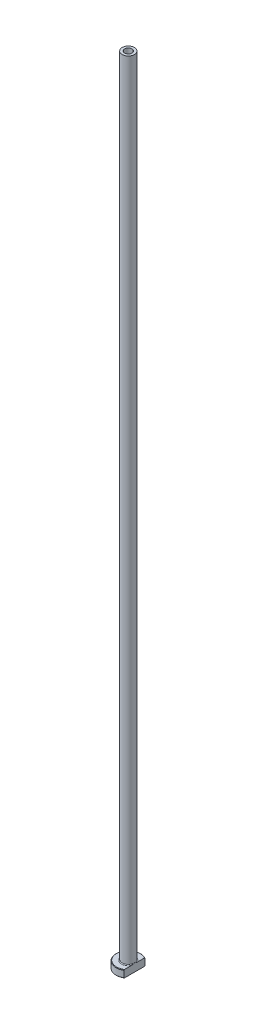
ISO-10303-21;
HEADER;
FILE_DESCRIPTION(('STEP AP214'),'2;1');
FILE_NAME('part.step','',(''),(''),'','','');
FILE_SCHEMA(('AUTOMOTIVE_DESIGN { 1 0 10303 214 1 1 1 1 }'));
ENDSEC;
DATA;
#1=APPLICATION_CONTEXT('core data for automotive mechanical design processes');
#2=APPLICATION_PROTOCOL_DEFINITION('international standard','automotive_design',2000,#1);
#3=PRODUCT_CONTEXT('',#1,'mechanical');
#4=PRODUCT('Part','Part','',(#3));
#5=PRODUCT_RELATED_PRODUCT_CATEGORY('part','',(#4));
#6=PRODUCT_DEFINITION_FORMATION('','',#4);
#7=PRODUCT_DEFINITION_CONTEXT('part definition',#1,'design');
#8=PRODUCT_DEFINITION('design','',#6,#7);
#9=PRODUCT_DEFINITION_SHAPE('','',#8);
#10=(LENGTH_UNIT() NAMED_UNIT(*) SI_UNIT(.MILLI.,.METRE.));
#11=(NAMED_UNIT(*) PLANE_ANGLE_UNIT() SI_UNIT($,.RADIAN.));
#12=(NAMED_UNIT(*) SI_UNIT($,.STERADIAN.) SOLID_ANGLE_UNIT());
#13=UNCERTAINTY_MEASURE_WITH_UNIT(LENGTH_MEASURE(1.E-05),#10,'distance_accuracy_value','');
#14=(GEOMETRIC_REPRESENTATION_CONTEXT(3) GLOBAL_UNCERTAINTY_ASSIGNED_CONTEXT((#13)) GLOBAL_UNIT_ASSIGNED_CONTEXT((#10,
#11,#12)) REPRESENTATION_CONTEXT('',''));
#15=CARTESIAN_POINT('',(0.,0.,0.));
#16=DIRECTION('',(0.,0.,1.));
#17=DIRECTION('',(1.,0.,0.));
#18=AXIS2_PLACEMENT_3D('',#15,#16,#17);
#19=CARTESIAN_POINT('',(0.,92.1876809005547,0.));
#20=DIRECTION('',(0.,1.,0.));
#21=DIRECTION('',(0.,0.,1.));
#22=AXIS2_PLACEMENT_3D('',#19,#20,#21);
#23=CYLINDRICAL_SURFACE('',#22,1.50000000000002);
#24=CARTESIAN_POINT('',(0.,325.,0.));
#25=DIRECTION('',(0.,1.,0.));
#26=DIRECTION('',(0.,0.,1.));
#27=AXIS2_PLACEMENT_3D('',#24,#25,#26);
#28=CIRCLE('',#27,1.50000000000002);
#29=CARTESIAN_POINT('',(0.,325.,1.50000000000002));
#30=VERTEX_POINT('',#29);
#31=EDGE_CURVE('E167',#30,#30,#28,.T.);
#32=ORIENTED_EDGE('',*,*,#31,.T.);
#33=EDGE_LOOP('',(#32));
#34=FACE_BOUND('',#33,.T.);
#35=CARTESIAN_POINT('',(0.,280.,0.));
#36=DIRECTION('',(0.,1.,0.));
#37=DIRECTION('',(0.,0.,1.));
#38=AXIS2_PLACEMENT_3D('',#35,#36,#37);
#39=CIRCLE('',#38,1.50000000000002);
#40=CARTESIAN_POINT('',(0.,280.,1.50000000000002));
#41=VERTEX_POINT('',#40);
#42=EDGE_CURVE('E170',#41,#41,#39,.T.);
#43=ORIENTED_EDGE('',*,*,#42,.F.);
#44=EDGE_LOOP('',(#43));
#45=FACE_BOUND('',#44,.T.);
#46=ADVANCED_FACE('F32',(#34,#45),#23,.F.);
#47=CARTESIAN_POINT('',(-1.50000000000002,325.,0.));
#48=DIRECTION('',(0.,1.,0.));
#49=DIRECTION('',(0.,0.,1.));
#50=AXIS2_PLACEMENT_3D('',#47,#48,#49);
#51=PLANE('',#50);
#52=CARTESIAN_POINT('',(0.,325.,0.));
#53=DIRECTION('',(0.,1.,0.));
#54=DIRECTION('',(0.,0.,1.));
#55=AXIS2_PLACEMENT_3D('',#52,#53,#54);
#56=CIRCLE('',#55,2.50000000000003);
#57=CARTESIAN_POINT('',(0.,325.,2.50000000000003));
#58=VERTEX_POINT('',#57);
#59=EDGE_CURVE('E174',#58,#58,#56,.T.);
#60=ORIENTED_EDGE('',*,*,#59,.T.);
#61=EDGE_LOOP('',(#60));
#62=FACE_BOUND('',#61,.T.);
#63=ORIENTED_EDGE('',*,*,#31,.F.);
#64=EDGE_LOOP('',(#63));
#65=FACE_BOUND('',#64,.T.);
#66=ADVANCED_FACE('F157',(#62,#65),#51,.T.);
#67=CARTESIAN_POINT('',(0.,92.1876809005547,0.));
#68=DIRECTION('',(0.,1.,0.));
#69=DIRECTION('',(0.,0.,1.));
#70=AXIS2_PLACEMENT_3D('',#67,#68,#69);
#71=CYLINDRICAL_SURFACE('',#70,2.50000000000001);
#72=CARTESIAN_POINT('',(0.,3.3,0.));
#73=DIRECTION('',(0.,1.,0.));
#74=DIRECTION('',(0.,0.,1.));
#75=AXIS2_PLACEMENT_3D('',#72,#73,#74);
#76=CIRCLE('',#75,2.50000000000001);
#77=CARTESIAN_POINT('',(2.5,3.3,0.));
#78=VERTEX_POINT('',#77);
#79=EDGE_CURVE('E180',#78,#78,#76,.T.);
#80=ORIENTED_EDGE('',*,*,#79,.T.);
#81=EDGE_LOOP('',(#80));
#82=FACE_BOUND('',#81,.T.);
#83=ORIENTED_EDGE('',*,*,#59,.F.);
#84=EDGE_LOOP('',(#83));
#85=FACE_BOUND('',#84,.T.);
#86=ADVANCED_FACE('F162',(#82,#85),#71,.T.);
#87=CARTESIAN_POINT('',(-2.49999999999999,3.,0.));
#88=DIRECTION('',(0.,1.,0.));
#89=DIRECTION('',(0.,0.,1.));
#90=AXIS2_PLACEMENT_3D('',#87,#88,#89);
#91=PLANE('',#90);
#92=DIRECTION('',(0.,0.,1.));
#93=VECTOR('',#92,1.);
#94=CARTESIAN_POINT('',(2.49999999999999,3.,0.));
#95=LINE('',#94,#93);
#96=CARTESIAN_POINT('',(2.5,3.,-4.09756024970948));
#97=VERTEX_POINT('',#96);
#98=CARTESIAN_POINT('',(2.49999999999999,3.,-1.26095202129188));
#99=VERTEX_POINT('',#98);
#100=EDGE_CURVE('E54',#97,#99,#95,.T.);
#101=ORIENTED_EDGE('',*,*,#100,.F.);
#102=CARTESIAN_POINT('',(0.,3.,0.));
#103=DIRECTION('',(0.,1.,0.));
#104=DIRECTION('',(0.,0.,1.));
#105=AXIS2_PLACEMENT_3D('',#102,#103,#104);
#106=CIRCLE('',#105,4.79999999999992);
#107=CARTESIAN_POINT('',(2.49999999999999,3.,4.09756024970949));
#108=VERTEX_POINT('',#107);
#109=EDGE_CURVE('E186',#97,#108,#106,.T.);
#110=ORIENTED_EDGE('',*,*,#109,.T.);
#111=CARTESIAN_POINT('',(2.49999999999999,3.,1.26095202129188));
#112=VERTEX_POINT('',#111);
#113=EDGE_CURVE('E134',#112,#108,#95,.T.);
#114=ORIENTED_EDGE('',*,*,#113,.F.);
#115=CARTESIAN_POINT('',(0.,3.,0.));
#116=DIRECTION('',(0.,1.,0.));
#117=DIRECTION('',(0.,0.,1.));
#118=AXIS2_PLACEMENT_3D('',#115,#116,#117);
#119=CIRCLE('',#118,2.80000000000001);
#120=EDGE_CURVE('E183',#112,#99,#119,.F.);
#121=ORIENTED_EDGE('',*,*,#120,.T.);
#122=EDGE_LOOP('',(#101,#110,#114,#121));
#123=FACE_BOUND('',#122,.T.);
#124=ADVANCED_FACE('F197',(#123),#91,.T.);
#125=CARTESIAN_POINT('',(0.,92.1876809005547,0.));
#126=DIRECTION('',(0.,1.,0.));
#127=DIRECTION('',(0.,0.,1.));
#128=AXIS2_PLACEMENT_3D('',#125,#126,#127);
#129=CYLINDRICAL_SURFACE('',#128,4.99999999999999);
#130=DIRECTION('',(0.,-1.,0.));
#131=VECTOR('',#130,1.);
#132=CARTESIAN_POINT('',(2.49999999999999,325.,4.33012701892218));
#133=LINE('',#132,#131);
#134=CARTESIAN_POINT('',(2.49999999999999,2.79999999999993,4.33012701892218));
#135=VERTEX_POINT('',#134);
#136=CARTESIAN_POINT('',(2.49999999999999,0.200000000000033,4.33012701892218));
#137=VERTEX_POINT('',#136);
#138=EDGE_CURVE('E82',#135,#137,#133,.T.);
#139=ORIENTED_EDGE('',*,*,#138,.F.);
#140=CARTESIAN_POINT('',(0.,2.79999999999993,0.));
#141=DIRECTION('',(0.,1.,0.));
#142=DIRECTION('',(0.,0.,1.));
#143=AXIS2_PLACEMENT_3D('',#140,#141,#142);
#144=CIRCLE('',#143,4.99999999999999);
#145=CARTESIAN_POINT('',(2.5,2.79999999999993,-4.33012701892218));
#146=VERTEX_POINT('',#145);
#147=EDGE_CURVE('E95',#135,#146,#144,.F.);
#148=ORIENTED_EDGE('',*,*,#147,.T.);
#149=DIRECTION('',(0.,-1.,0.));
#150=VECTOR('',#149,1.);
#151=CARTESIAN_POINT('',(2.5,325.,-4.33012701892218));
#152=LINE('',#151,#150);
#153=CARTESIAN_POINT('',(2.5,0.200000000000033,-4.33012701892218));
#154=VERTEX_POINT('',#153);
#155=EDGE_CURVE('E192',#146,#154,#152,.T.);
#156=ORIENTED_EDGE('',*,*,#155,.T.);
#157=CARTESIAN_POINT('',(0.,0.200000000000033,0.));
#158=DIRECTION('',(0.,-1.,0.));
#159=DIRECTION('',(0.,0.,-1.));
#160=AXIS2_PLACEMENT_3D('',#157,#158,#159);
#161=CIRCLE('',#160,4.99999999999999);
#162=EDGE_CURVE('E98',#154,#137,#161,.F.);
#163=ORIENTED_EDGE('',*,*,#162,.T.);
#164=EDGE_LOOP('',(#139,#148,#156,#163));
#165=FACE_BOUND('',#164,.T.);
#166=ADVANCED_FACE('F190',(#165),#129,.T.);
#167=CARTESIAN_POINT('',(-4.99999999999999,0.,0.));
#168=DIRECTION('',(0.,-1.,0.));
#169=DIRECTION('',(0.,0.,-1.));
#170=AXIS2_PLACEMENT_3D('',#167,#168,#169);
#171=PLANE('',#170);
#172=CARTESIAN_POINT('',(0.,0.,0.));
#173=DIRECTION('',(0.,-1.,0.));
#174=DIRECTION('',(0.,0.,-1.));
#175=AXIS2_PLACEMENT_3D('',#172,#173,#174);
#176=CIRCLE('',#175,2.25000000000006);
#177=CARTESIAN_POINT('',(0.,0.,-2.25000000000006));
#178=VERTEX_POINT('',#177);
#179=EDGE_CURVE('E40',#178,#178,#176,.F.);
#180=ORIENTED_EDGE('',*,*,#179,.T.);
#181=EDGE_LOOP('',(#180));
#182=FACE_BOUND('',#181,.T.);
#183=DIRECTION('',(0.,0.,-1.));
#184=VECTOR('',#183,1.);
#185=CARTESIAN_POINT('',(2.49999999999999,0.,4.33012701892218));
#186=LINE('',#185,#184);
#187=CARTESIAN_POINT('',(2.49999999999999,0.,4.09756024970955));
#188=VERTEX_POINT('',#187);
#189=CARTESIAN_POINT('',(2.5,0.,-4.09756024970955));
#190=VERTEX_POINT('',#189);
#191=EDGE_CURVE('E47',#188,#190,#186,.T.);
#192=ORIENTED_EDGE('',*,*,#191,.F.);
#193=CARTESIAN_POINT('',(0.,0.,0.));
#194=DIRECTION('',(0.,-1.,0.));
#195=DIRECTION('',(0.,0.,-1.));
#196=AXIS2_PLACEMENT_3D('',#193,#194,#195);
#197=CIRCLE('',#196,4.79999999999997);
#198=EDGE_CURVE('E92',#188,#190,#197,.T.);
#199=ORIENTED_EDGE('',*,*,#198,.T.);
#200=EDGE_LOOP('',(#192,#199));
#201=FACE_BOUND('',#200,.T.);
#202=ADVANCED_FACE('F91',(#182,#201),#171,.T.);
#203=CARTESIAN_POINT('',(0.,92.1876809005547,0.));
#204=DIRECTION('',(0.,1.,0.));
#205=DIRECTION('',(0.,0.,1.));
#206=AXIS2_PLACEMENT_3D('',#203,#204,#205);
#207=CYLINDRICAL_SURFACE('',#206,1.75000000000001);
#208=CARTESIAN_POINT('',(0.,0.500000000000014,0.));
#209=DIRECTION('',(0.,-1.,0.));
#210=DIRECTION('',(0.,0.,-1.));
#211=AXIS2_PLACEMENT_3D('',#208,#209,#210);
#212=CIRCLE('',#211,1.75000000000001);
#213=CARTESIAN_POINT('',(0.,0.500000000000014,-1.75000000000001));
#214=VERTEX_POINT('',#213);
#215=EDGE_CURVE('E11',#214,#214,#212,.T.);
#216=ORIENTED_EDGE('',*,*,#215,.T.);
#217=EDGE_LOOP('',(#216));
#218=FACE_BOUND('',#217,.T.);
#219=CARTESIAN_POINT('',(0.,268.,0.));
#220=DIRECTION('',(0.,1.,0.));
#221=DIRECTION('',(0.,0.,1.));
#222=AXIS2_PLACEMENT_3D('',#219,#220,#221);
#223=CIRCLE('',#222,1.75000000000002);
#224=CARTESIAN_POINT('',(0.,268.,1.75000000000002));
#225=VERTEX_POINT('',#224);
#226=EDGE_CURVE('E172',#225,#225,#223,.T.);
#227=ORIENTED_EDGE('',*,*,#226,.T.);
#228=EDGE_LOOP('',(#227));
#229=FACE_BOUND('',#228,.T.);
#230=ADVANCED_FACE('F215',(#218,#229),#207,.F.);
#231=CARTESIAN_POINT('',(0.,268.,0.));
#232=DIRECTION('',(0.,-1.,0.));
#233=DIRECTION('',(0.,0.,-1.));
#234=AXIS2_PLACEMENT_3D('',#231,#232,#233);
#235=CONICAL_SURFACE('',#234,1.75000000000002,0.0208303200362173);
#236=ORIENTED_EDGE('',*,*,#42,.T.);
#237=EDGE_LOOP('',(#236));
#238=FACE_BOUND('',#237,.T.);
#239=ORIENTED_EDGE('',*,*,#226,.F.);
#240=EDGE_LOOP('',(#239));
#241=FACE_BOUND('',#240,.T.);
#242=ADVANCED_FACE('F111',(#238,#241),#235,.F.);
#243=CARTESIAN_POINT('',(0.,3.3,0.));
#244=DIRECTION('',(0.,1.,0.));
#245=DIRECTION('',(0.,0.,1.));
#246=AXIS2_PLACEMENT_3D('',#243,#244,#245);
#247=TOROIDAL_SURFACE('',#246,2.80000000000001,0.3);
#248=ORIENTED_EDGE('',*,*,#120,.F.);
#249=CARTESIAN_POINT('',(2.5,3.3,0.));
#250=CARTESIAN_POINT('',(2.5,3.30000062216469,-4.84331938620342E-11));
#251=CARTESIAN_POINT('',(2.5,3.30000124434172,1.596211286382E-07));
#252=CARTESIAN_POINT('',(2.5,3.30000243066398,6.4547816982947E-07));
#253=CARTESIAN_POINT('',(2.5,3.30000299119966,9.78480972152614E-07));
#254=CARTESIAN_POINT('',(2.5,3.30000411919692,1.77472021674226E-06));
#255=CARTESIAN_POINT('',(2.5,3.30000467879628,2.24902194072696E-06));
#256=CARTESIAN_POINT('',(2.5,3.30000572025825,3.25953741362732E-06));
#257=CARTESIAN_POINT('',(2.5,3.30000620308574,3.79480804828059E-06));
#258=CARTESIAN_POINT('',(2.5,3.30000787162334,5.75794736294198E-06));
#259=CARTESIAN_POINT('',(2.5,3.30000896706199,7.2642425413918E-06));
#260=CARTESIAN_POINT('',(2.5,3.30001087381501,1.03361146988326E-05));
#261=CARTESIAN_POINT('',(2.5,3.30001169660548,1.18949516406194E-05));
#262=CARTESIAN_POINT('',(2.5,3.30001489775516,1.81400881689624E-05));
#263=CARTESIAN_POINT('',(2.5,3.30001712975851,2.29062218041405E-05));
#264=CARTESIAN_POINT('',(2.5,3.30002067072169,3.21793914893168E-05));
#265=CARTESIAN_POINT('',(2.5,3.30002205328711,3.66589034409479E-05));
#266=CARTESIAN_POINT('',(2.5,3.30002810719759,5.6171847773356E-05));
#267=CARTESIAN_POINT('',(2.5,3.30003284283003,7.1173596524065E-05));
#268=CARTESIAN_POINT('',(2.5,3.30004025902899,9.8992044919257E-05));
#269=CARTESIAN_POINT('',(2.5,3.3000431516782,0.00011174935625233));
#270=CARTESIAN_POINT('',(2.49999999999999,3.30006652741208,0.000206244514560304));
#271=CARTESIAN_POINT('',(2.49999999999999,3.30009698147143,0.000285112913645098));
#272=CARTESIAN_POINT('',(2.5,3.30021213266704,0.000594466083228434));
#273=CARTESIAN_POINT('',(2.5,3.30028938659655,0.000826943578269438));
#274=CARTESIAN_POINT('',(2.49999999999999,3.30059681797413,0.00173885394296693));
#275=CARTESIAN_POINT('',(2.49999999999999,3.30083479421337,0.00241625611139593));
#276=CARTESIAN_POINT('',(2.5,3.30181198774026,0.00521069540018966));
#277=CARTESIAN_POINT('',(2.5,3.30254240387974,0.00732996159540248));
#278=CARTESIAN_POINT('',(2.49999999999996,3.31226043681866,0.0355096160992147));
#279=CARTESIAN_POINT('',(2.49999999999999,3.32130808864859,0.0615551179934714));
#280=CARTESIAN_POINT('',(2.5,3.33896212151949,0.112677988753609));
#281=CARTESIAN_POINT('',(2.5,3.34757212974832,0.137754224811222));
#282=CARTESIAN_POINT('',(2.49999999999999,3.36573068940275,0.190981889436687));
#283=CARTESIAN_POINT('',(2.49999999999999,3.37526654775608,0.21913775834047));
#284=CARTESIAN_POINT('',(2.5,3.39422867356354,0.275816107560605));
#285=CARTESIAN_POINT('',(2.5,3.40365272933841,0.304339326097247));
#286=CARTESIAN_POINT('',(2.49999999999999,3.42641697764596,0.374416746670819));
#287=CARTESIAN_POINT('',(2.5,3.43959811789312,0.41602308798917));
#288=CARTESIAN_POINT('',(2.5,3.46479157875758,0.498481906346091));
#289=CARTESIAN_POINT('',(2.5,3.47682455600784,0.539328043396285));
#290=CARTESIAN_POINT('',(2.5,3.50224427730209,0.629981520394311));
#291=CARTESIAN_POINT('',(2.5,3.51538048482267,0.679860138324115));
#292=CARTESIAN_POINT('',(2.5,3.53964074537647,0.780511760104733));
#293=CARTESIAN_POINT('',(2.5,3.55074877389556,0.831288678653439));
#294=CARTESIAN_POINT('',(2.5,3.57087054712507,0.937063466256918));
#295=CARTESIAN_POINT('',(2.5,3.57967623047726,0.992102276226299));
#296=CARTESIAN_POINT('',(2.5,3.59301148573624,1.10256024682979));
#297=CARTESIAN_POINT('',(2.5,3.59755297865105,1.15797790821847));
#298=CARTESIAN_POINT('',(2.5,3.60093314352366,1.26786705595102));
#299=CARTESIAN_POINT('',(2.5,3.59989366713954,1.32233291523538));
#300=CARTESIAN_POINT('',(2.5,3.59277279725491,1.40310062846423));
#301=CARTESIAN_POINT('',(2.5,3.5895213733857,1.4296522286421));
#302=CARTESIAN_POINT('',(2.5,3.58085857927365,1.48239078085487));
#303=CARTESIAN_POINT('',(2.5,3.57544928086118,1.50857805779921));
#304=CARTESIAN_POINT('',(2.5,3.56298810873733,1.55658799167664));
#305=CARTESIAN_POINT('',(2.5,3.5562820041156,1.57849902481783));
#306=CARTESIAN_POINT('',(2.5,3.54055393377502,1.62160292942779));
#307=CARTESIAN_POINT('',(2.5,3.53152220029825,1.64279233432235));
#308=CARTESIAN_POINT('',(2.5,3.510571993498,1.68404469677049));
#309=CARTESIAN_POINT('',(2.5,3.4986201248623,1.70409105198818));
#310=CARTESIAN_POINT('',(2.5,3.47134074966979,1.74172093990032));
#311=CARTESIAN_POINT('',(2.5,3.4560312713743,1.75931683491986));
#312=CARTESIAN_POINT('',(2.5,3.42979930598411,1.78297070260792));
#313=CARTESIAN_POINT('',(2.5,3.42024268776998,1.79054141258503));
#314=CARTESIAN_POINT('',(2.5,3.40009035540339,1.80416997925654));
#315=CARTESIAN_POINT('',(2.5,3.38949499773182,1.81022835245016));
#316=CARTESIAN_POINT('',(2.5,3.36727740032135,1.82047087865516));
#317=CARTESIAN_POINT('',(2.5,3.35564531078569,1.82463409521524));
#318=CARTESIAN_POINT('',(2.5,3.33178837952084,1.83058442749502));
#319=CARTESIAN_POINT('',(2.5,3.31956435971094,1.83237474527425));
#320=CARTESIAN_POINT('',(2.5,3.29665736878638,1.8333185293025));
#321=CARTESIAN_POINT('',(2.5,3.28598670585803,1.83279233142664));
#322=CARTESIAN_POINT('',(2.5,3.26490749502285,1.82986307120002));
#323=CARTESIAN_POINT('',(2.5,3.25449899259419,1.82745968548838));
#324=CARTESIAN_POINT('',(2.5,3.23467098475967,1.82111257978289));
#325=CARTESIAN_POINT('',(2.5,3.22522816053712,1.81724026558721));
#326=CARTESIAN_POINT('',(2.5,3.20699535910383,1.80819497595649));
#327=CARTESIAN_POINT('',(2.5,3.19820556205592,1.80302164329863));
#328=CARTESIAN_POINT('',(2.5,3.1766316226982,1.78842115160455));
#329=CARTESIAN_POINT('',(2.5,3.16436228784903,1.77823293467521));
#330=CARTESIAN_POINT('',(2.5,3.14157828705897,1.75604629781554));
#331=CARTESIAN_POINT('',(2.5,3.13106906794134,1.74404246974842));
#332=CARTESIAN_POINT('',(2.5,3.10600520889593,1.71142114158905));
#333=CARTESIAN_POINT('',(2.5,3.09267476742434,1.68986887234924));
#334=CARTESIAN_POINT('',(2.5,3.06940323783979,1.64508572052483));
#335=CARTESIAN_POINT('',(2.5,3.05946314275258,1.62185434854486));
#336=CARTESIAN_POINT('',(2.5,3.03545750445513,1.55546754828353));
#337=CARTESIAN_POINT('',(2.5,3.02444022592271,1.51122187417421));
#338=CARTESIAN_POINT('',(2.5,3.00863926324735,1.42119777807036));
#339=CARTESIAN_POINT('',(2.5,3.00393876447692,1.37540689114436));
#340=CARTESIAN_POINT('',(2.5,2.9992421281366,1.28072198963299));
#341=CARTESIAN_POINT('',(2.5,2.99956098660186,1.23181420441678));
#342=CARTESIAN_POINT('',(2.5,3.00436098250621,1.13410944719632));
#343=CARTESIAN_POINT('',(2.5,3.00885327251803,1.08531312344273));
#344=CARTESIAN_POINT('',(2.5,3.02074191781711,0.990773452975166));
#345=CARTESIAN_POINT('',(2.5,3.02796792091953,0.945007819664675));
#346=CARTESIAN_POINT('',(2.5,3.0446555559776,0.854199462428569));
#347=CARTESIAN_POINT('',(2.5,3.05410250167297,0.80915398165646));
#348=CARTESIAN_POINT('',(2.5,3.07710029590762,0.709411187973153));
#349=CARTESIAN_POINT('',(2.5,3.0910963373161,0.654817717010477));
#350=CARTESIAN_POINT('',(2.5,3.12140740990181,0.544863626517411));
#351=CARTESIAN_POINT('',(2.49999999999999,3.13777040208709,0.489516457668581));
#352=CARTESIAN_POINT('',(2.5,3.16649540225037,0.396740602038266));
#353=CARTESIAN_POINT('',(2.5,3.17848130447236,0.359193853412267));
#354=CARTESIAN_POINT('',(2.49999999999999,3.20280507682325,0.28465180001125));
#355=CARTESIAN_POINT('',(2.49999999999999,3.21513791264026,0.247654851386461));
#356=CARTESIAN_POINT('',(2.5,3.2387371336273,0.177767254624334));
#357=CARTESIAN_POINT('',(2.50000000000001,3.24997409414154,0.144866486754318));
#358=CARTESIAN_POINT('',(2.49999999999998,3.273071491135,0.0777985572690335));
#359=CARTESIAN_POINT('',(2.49999999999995,3.28493883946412,0.0436336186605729));
#360=CARTESIAN_POINT('',(2.5,3.29745794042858,0.00732879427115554));
#361=CARTESIAN_POINT('',(2.5,3.29818879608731,0.00520838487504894));
#362=CARTESIAN_POINT('',(2.49999999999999,3.29916610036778,0.00241367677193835));
#363=CARTESIAN_POINT('',(2.49999999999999,3.29940376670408,0.00173715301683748));
#364=CARTESIAN_POINT('',(2.5,3.29971082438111,0.000826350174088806));
#365=CARTESIAN_POINT('',(2.5,3.29978800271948,0.000594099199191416));
#366=CARTESIAN_POINT('',(2.49999999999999,3.29990305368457,0.000285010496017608));
#367=CARTESIAN_POINT('',(2.49999999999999,3.29993349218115,0.000206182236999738));
#368=CARTESIAN_POINT('',(2.5,3.29995685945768,0.000111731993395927));
#369=CARTESIAN_POINT('',(2.5,3.29995975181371,9.89774443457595E-05));
#370=CARTESIAN_POINT('',(2.5,3.29996716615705,7.11651982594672E-05));
#371=CARTESIAN_POINT('',(2.5,3.29997189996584,5.61668168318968E-05));
#372=CARTESIAN_POINT('',(2.5,3.29997795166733,3.66576373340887E-05));
#373=CARTESIAN_POINT('',(2.5,3.29997933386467,3.21785292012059E-05));
#374=CARTESIAN_POINT('',(2.5,3.29998287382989,2.29061413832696E-05));
#375=CARTESIAN_POINT('',(2.5,3.29998510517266,1.81403690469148E-05));
#376=CARTESIAN_POINT('',(2.5,3.2999883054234,1.18955839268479E-05));
#377=CARTESIAN_POINT('',(2.5,3.29998912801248,1.03367779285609E-05));
#378=CARTESIAN_POINT('',(2.5,3.29999103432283,7.26492926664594E-06));
#379=CARTESIAN_POINT('',(2.5,3.29999212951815,5.75862391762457E-06));
#380=CARTESIAN_POINT('',(2.5,3.2999937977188,3.79542532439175E-06));
#381=CARTESIAN_POINT('',(2.5,3.29999428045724,3.26012824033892E-06));
#382=CARTESIAN_POINT('',(2.5,3.29999532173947,2.24954383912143E-06));
#383=CARTESIAN_POINT('',(2.5,3.29999588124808,1.77519935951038E-06));
#384=CARTESIAN_POINT('',(2.5,3.29999700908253,9.78857368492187E-07));
#385=CARTESIAN_POINT('',(2.5,3.29999756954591,6.45797267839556E-07));
#386=CARTESIAN_POINT('',(2.5,3.29999875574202,1.59799691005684E-07));
#387=CARTESIAN_POINT('',(2.5,3.29999937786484,4.84313949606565E-11));
#388=CARTESIAN_POINT('',(2.5,3.3,0.));
#389=B_SPLINE_CURVE_WITH_KNOTS('',3,(#249,#250,#251,#252,#253,#254,#255,#256,#257,#258,#259,
#260,#261,#262,#263,#264,#265,#266,#267,#268,#269,#270,#271,#272,#273,#274,#275,#276,#277,#278,
#279,#280,#281,#282,#283,#284,#285,#286,#287,#288,#289,#290,#291,#292,#293,#294,#295,#296,#297,
#298,#299,#300,#301,#302,#303,#304,#305,#306,#307,#308,#309,#310,#311,#312,#313,#314,#315,#316,
#317,#318,#319,#320,#321,#322,#323,#324,#325,#326,#327,#328,#329,#330,#331,#332,#333,#334,#335,
#336,#337,#338,#339,#340,#341,#342,#343,#344,#345,#346,#347,#348,#349,#350,#351,#352,#353,#354,
#355,#356,#357,#358,#359,#360,#361,#362,#363,#364,#365,#366,#367,#368,#369,#370,#371,#372,#373,
#374,#375,#376,#377,#378,#379,#380,#381,#382,#383,#384,#385,#386,#387,#388),.UNSPECIFIED.,.T.,
.F.,(4,2,2,2,2,2,2,2,2,2,2,2,2,2,2,2,2,2,2,2,2,2,2,2,2,2,2,2,2,2,2,2,2,2,2,2,2,2,2,2,2,2,2,2,2,
2,2,2,2,2,2,2,2,2,2,2,2,2,2,2,2,2,2,2,2,2,2,2,2,4),(0.,1.86789060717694E-06,
3.81549288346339E-06,6.00610035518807E-06,8.16652411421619E-06,1.37285523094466E-05,
1.90122086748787E-05,3.47597207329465E-05,4.88082513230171E-05,9.59978378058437E-05,
0.000135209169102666,0.000388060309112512,0.00112364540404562,0.00327678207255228,
0.0100024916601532,0.0927120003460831,0.172253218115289,0.261432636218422,0.351551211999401,
0.482477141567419,0.610212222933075,0.764915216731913,0.920792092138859,1.08787897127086,
1.25449733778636,1.41749285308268,1.49767530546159,1.5777809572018,1.6464248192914,
1.71536183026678,1.78512750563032,1.85452737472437,1.89099315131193,1.92744645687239,
1.96429324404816,2.00109025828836,2.03297105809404,2.06485735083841,2.09535926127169,
2.12586955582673,2.17344034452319,2.22115572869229,2.29675134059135,2.37236907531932,
2.50839721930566,2.64619971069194,2.7926828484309,2.93955855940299,3.07848421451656,
3.21651583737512,3.3855404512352,3.55865938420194,3.67689643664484,3.79388863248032,
3.89819085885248,4.00668323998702,4.01341261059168,4.01556295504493,4.01629782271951,
4.01655054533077,4.01658974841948,4.01663692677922,4.01665097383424,4.01666671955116,
4.01667200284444,4.01667756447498,4.01667972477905,4.0166819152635,4.01668386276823,
4.01668573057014),.UNSPECIFIED.);
#390=EDGE_CURVE('E126',#112,#78,#389,.T.);
#391=ORIENTED_EDGE('',*,*,#390,.T.);
#392=ORIENTED_EDGE('',*,*,#79,.F.);
#393=CARTESIAN_POINT('',(2.5,3.3,0.));
#394=CARTESIAN_POINT('',(2.5,3.2999993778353,4.84336248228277E-11));
#395=CARTESIAN_POINT('',(2.5,3.29999875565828,-1.59621128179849E-07));
#396=CARTESIAN_POINT('',(2.5,3.29999756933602,-6.45478169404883E-07));
#397=CARTESIAN_POINT('',(2.5,3.29999700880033,-9.78480971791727E-07));
#398=CARTESIAN_POINT('',(2.5,3.29999588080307,-1.77472021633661E-06));
#399=CARTESIAN_POINT('',(2.5,3.29999532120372,-2.24902194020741E-06));
#400=CARTESIAN_POINT('',(2.5,3.29999427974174,-3.25953741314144E-06));
#401=CARTESIAN_POINT('',(2.5,3.29999379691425,-3.79480804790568E-06));
#402=CARTESIAN_POINT('',(2.5,3.29999212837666,-5.75794736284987E-06));
#403=CARTESIAN_POINT('',(2.5,3.299991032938,-7.26424254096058E-06));
#404=CARTESIAN_POINT('',(2.5,3.29998912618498,-1.03361146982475E-05));
#405=CARTESIAN_POINT('',(2.5,3.29998830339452,-1.18949516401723E-05));
#406=CARTESIAN_POINT('',(2.5,3.29998510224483,-1.81400881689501E-05));
#407=CARTESIAN_POINT('',(2.5,3.29998287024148,-2.29062218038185E-05));
#408=CARTESIAN_POINT('',(2.5,3.2999793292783,-3.21793914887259E-05));
#409=CARTESIAN_POINT('',(2.5,3.29997794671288,-3.66589034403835E-05));
#410=CARTESIAN_POINT('',(2.5,3.29997189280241,-5.61718477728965E-05));
#411=CARTESIAN_POINT('',(2.5,3.29996715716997,-7.1173596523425E-05));
#412=CARTESIAN_POINT('',(2.5,3.299959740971,-9.89920449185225E-05));
#413=CARTESIAN_POINT('',(2.5,3.29995684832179,-0.000111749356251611));
#414=CARTESIAN_POINT('',(2.49999999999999,3.29993347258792,-0.000206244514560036));
#415=CARTESIAN_POINT('',(2.49999999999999,3.29990301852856,-0.000285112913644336));
#416=CARTESIAN_POINT('',(2.5,3.29978786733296,-0.000594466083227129));
#417=CARTESIAN_POINT('',(2.5,3.29971061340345,-0.000826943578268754));
#418=CARTESIAN_POINT('',(2.49999999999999,3.29940318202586,-0.00173885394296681));
#419=CARTESIAN_POINT('',(2.49999999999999,3.29916520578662,-0.00241625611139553));
#420=CARTESIAN_POINT('',(2.5,3.29818801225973,-0.00521069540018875));
#421=CARTESIAN_POINT('',(2.5,3.29745759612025,-0.00732996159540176));
#422=CARTESIAN_POINT('',(2.49999999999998,3.28773956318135,-0.035509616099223));
#423=CARTESIAN_POINT('',(2.49999999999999,3.27869191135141,-0.0615551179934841));
#424=CARTESIAN_POINT('',(2.5,3.2610378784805,-0.112677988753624));
#425=CARTESIAN_POINT('',(2.5,3.25242787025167,-0.137754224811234));
#426=CARTESIAN_POINT('',(2.49999999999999,3.23426931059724,-0.190981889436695));
#427=CARTESIAN_POINT('',(2.49999999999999,3.22473345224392,-0.219137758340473));
#428=CARTESIAN_POINT('',(2.5,3.20577132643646,-0.275816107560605));
#429=CARTESIAN_POINT('',(2.5,3.19634727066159,-0.304339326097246));
#430=CARTESIAN_POINT('',(2.5,3.17358302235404,-0.374416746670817));
#431=CARTESIAN_POINT('',(2.5,3.16040188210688,-0.416023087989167));
#432=CARTESIAN_POINT('',(2.5,3.13520842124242,-0.498481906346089));
#433=CARTESIAN_POINT('',(2.5,3.12317544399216,-0.539328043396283));
#434=CARTESIAN_POINT('',(2.5,3.0977557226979,-0.629981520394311));
#435=CARTESIAN_POINT('',(2.5,3.08461951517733,-0.679860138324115));
#436=CARTESIAN_POINT('',(2.5,3.06035925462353,-0.780511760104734));
#437=CARTESIAN_POINT('',(2.5,3.04925122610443,-0.831288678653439));
#438=CARTESIAN_POINT('',(2.5,3.02912945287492,-0.937063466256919));
#439=CARTESIAN_POINT('',(2.5,3.02032376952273,-0.9921022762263));
#440=CARTESIAN_POINT('',(2.5,3.00698851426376,-1.10256024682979));
#441=CARTESIAN_POINT('',(2.5,3.00244702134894,-1.15797790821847));
#442=CARTESIAN_POINT('',(2.5,2.99906685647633,-1.26786705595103));
#443=CARTESIAN_POINT('',(2.5,3.00010633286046,-1.32233291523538));
#444=CARTESIAN_POINT('',(2.5,3.00722720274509,-1.40310062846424));
#445=CARTESIAN_POINT('',(2.5,3.01047862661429,-1.4296522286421));
#446=CARTESIAN_POINT('',(2.5,3.01914142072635,-1.48239078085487));
#447=CARTESIAN_POINT('',(2.5,3.02455071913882,-1.50857805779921));
#448=CARTESIAN_POINT('',(2.5,3.03701189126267,-1.55658799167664));
#449=CARTESIAN_POINT('',(2.5,3.0437179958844,-1.57849902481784));
#450=CARTESIAN_POINT('',(2.5,3.05944606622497,-1.62160292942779));
#451=CARTESIAN_POINT('',(2.5,3.06847779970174,-1.64279233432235));
#452=CARTESIAN_POINT('',(2.5,3.08942800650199,-1.68404469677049));
#453=CARTESIAN_POINT('',(2.5,3.1013798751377,-1.70409105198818));
#454=CARTESIAN_POINT('',(2.5,3.1286592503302,-1.74172093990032));
#455=CARTESIAN_POINT('',(2.5,3.14396872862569,-1.75931683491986));
#456=CARTESIAN_POINT('',(2.5,3.17020069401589,-1.78297070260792));
#457=CARTESIAN_POINT('',(2.5,3.17975731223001,-1.79054141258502));
#458=CARTESIAN_POINT('',(2.5,3.1999096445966,-1.80416997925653));
#459=CARTESIAN_POINT('',(2.5,3.21050500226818,-1.81022835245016));
#460=CARTESIAN_POINT('',(2.5,3.23272259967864,-1.82047087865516));
#461=CARTESIAN_POINT('',(2.5,3.2443546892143,-1.82463409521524));
#462=CARTESIAN_POINT('',(2.5,3.26821162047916,-1.83058442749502));
#463=CARTESIAN_POINT('',(2.5,3.28043564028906,-1.83237474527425));
#464=CARTESIAN_POINT('',(2.5,3.30334263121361,-1.8333185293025));
#465=CARTESIAN_POINT('',(2.5,3.31401329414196,-1.83279233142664));
#466=CARTESIAN_POINT('',(2.5,3.33509250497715,-1.82986307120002));
#467=CARTESIAN_POINT('',(2.5,3.34550100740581,-1.82745968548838));
#468=CARTESIAN_POINT('',(2.5,3.36532901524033,-1.82111257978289));
#469=CARTESIAN_POINT('',(2.5,3.37477183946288,-1.81724026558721));
#470=CARTESIAN_POINT('',(2.5,3.39300464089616,-1.80819497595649));
#471=CARTESIAN_POINT('',(2.5,3.40179443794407,-1.80302164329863));
#472=CARTESIAN_POINT('',(2.5,3.42336837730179,-1.78842115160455));
#473=CARTESIAN_POINT('',(2.5,3.43563771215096,-1.77823293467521));
#474=CARTESIAN_POINT('',(2.5,3.45842171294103,-1.75604629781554));
#475=CARTESIAN_POINT('',(2.5,3.46893093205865,-1.74404246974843));
#476=CARTESIAN_POINT('',(2.5,3.49399479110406,-1.71142114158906));
#477=CARTESIAN_POINT('',(2.5,3.50732523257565,-1.68986887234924));
#478=CARTESIAN_POINT('',(2.5,3.5305967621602,-1.64508572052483));
#479=CARTESIAN_POINT('',(2.5,3.54053685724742,-1.62185434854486));
#480=CARTESIAN_POINT('',(2.5,3.56454249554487,-1.55546754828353));
#481=CARTESIAN_POINT('',(2.5,3.57555977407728,-1.51122187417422));
#482=CARTESIAN_POINT('',(2.5,3.59136073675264,-1.42119777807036));
#483=CARTESIAN_POINT('',(2.5,3.59606123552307,-1.37540689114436));
#484=CARTESIAN_POINT('',(2.5,3.60075787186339,-1.28072198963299));
#485=CARTESIAN_POINT('',(2.5,3.60043901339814,-1.23181420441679));
#486=CARTESIAN_POINT('',(2.5,3.59563901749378,-1.13410944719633));
#487=CARTESIAN_POINT('',(2.5,3.59114672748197,-1.08531312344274));
#488=CARTESIAN_POINT('',(2.5,3.57925808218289,-0.990773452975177));
#489=CARTESIAN_POINT('',(2.5,3.57203207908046,-0.945007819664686));
#490=CARTESIAN_POINT('',(2.5,3.5553444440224,-0.85419946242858));
#491=CARTESIAN_POINT('',(2.5,3.54589749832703,-0.809153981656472));
#492=CARTESIAN_POINT('',(2.5,3.52289970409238,-0.709411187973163));
#493=CARTESIAN_POINT('',(2.5,3.5089036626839,-0.654817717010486));
#494=CARTESIAN_POINT('',(2.5,3.47859259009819,-0.544863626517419));
#495=CARTESIAN_POINT('',(2.49999999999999,3.4622295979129,-0.489516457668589));
#496=CARTESIAN_POINT('',(2.5,3.43350459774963,-0.396740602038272));
#497=CARTESIAN_POINT('',(2.5,3.42151869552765,-0.35919385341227));
#498=CARTESIAN_POINT('',(2.49999999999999,3.39719492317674,-0.284651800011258));
#499=CARTESIAN_POINT('',(2.49999999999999,3.38486208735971,-0.247654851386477));
#500=CARTESIAN_POINT('',(2.5,3.36126286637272,-0.17776725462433));
#501=CARTESIAN_POINT('',(2.5,3.35002590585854,-0.14486648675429));
#502=CARTESIAN_POINT('',(2.49999999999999,3.3269285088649,-0.0777985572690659));
#503=CARTESIAN_POINT('',(2.49999999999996,3.31506116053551,-0.0436336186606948));
#504=CARTESIAN_POINT('',(2.5,3.30254205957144,-0.00732879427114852));
#505=CARTESIAN_POINT('',(2.5,3.30181120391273,-0.00520838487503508));
#506=CARTESIAN_POINT('',(2.49999999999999,3.30083389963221,-0.00241367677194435));
#507=CARTESIAN_POINT('',(2.49999999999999,3.30059623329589,-0.00173715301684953));
#508=CARTESIAN_POINT('',(2.5,3.30028917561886,-0.000826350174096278));
#509=CARTESIAN_POINT('',(2.5,3.3002119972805,-0.000594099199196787));
#510=CARTESIAN_POINT('',(2.49999999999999,3.30009694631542,-0.000285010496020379));
#511=CARTESIAN_POINT('',(2.49999999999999,3.30006650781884,-0.000206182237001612));
#512=CARTESIAN_POINT('',(2.5,3.30004314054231,-0.000111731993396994));
#513=CARTESIAN_POINT('',(2.5,3.30004024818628,-9.89774443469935E-05));
#514=CARTESIAN_POINT('',(2.5,3.30003283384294,-7.11651982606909E-05));
#515=CARTESIAN_POINT('',(2.5,3.30002810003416,-5.61668168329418E-05));
#516=CARTESIAN_POINT('',(2.5,3.30002204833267,-3.66576373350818E-05));
#517=CARTESIAN_POINT('',(2.5,3.30002066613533,-3.21785292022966E-05));
#518=CARTESIAN_POINT('',(2.5,3.3000171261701,-2.29061413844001E-05));
#519=CARTESIAN_POINT('',(2.5,3.30001489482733,-1.81403690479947E-05));
#520=CARTESIAN_POINT('',(2.5,3.3000116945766,-1.18955839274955E-05));
#521=CARTESIAN_POINT('',(2.5,3.30001087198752,-1.03367779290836E-05));
#522=CARTESIAN_POINT('',(2.5,3.30000896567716,-7.26492926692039E-06));
#523=CARTESIAN_POINT('',(2.5,3.30000787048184,-5.75862391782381E-06));
#524=CARTESIAN_POINT('',(2.5,3.30000620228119,-3.79542532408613E-06));
#525=CARTESIAN_POINT('',(2.5,3.30000571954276,-3.26012823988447E-06));
#526=CARTESIAN_POINT('',(2.5,3.30000467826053,-2.24954383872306E-06));
#527=CARTESIAN_POINT('',(2.5,3.30000411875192,-1.77519935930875E-06));
#528=CARTESIAN_POINT('',(2.5,3.30000299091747,-9.78857368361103E-07));
#529=CARTESIAN_POINT('',(2.5,3.30000243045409,-6.45797267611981E-07));
#530=CARTESIAN_POINT('',(2.5,3.30000124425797,-1.59799690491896E-07));
#531=CARTESIAN_POINT('',(2.5,3.30000062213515,-4.84308244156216E-11));
#532=CARTESIAN_POINT('',(2.5,3.3,0.));
#533=B_SPLINE_CURVE_WITH_KNOTS('',3,(#393,#394,#395,#396,#397,#398,#399,#400,#401,#402,#403,
#404,#405,#406,#407,#408,#409,#410,#411,#412,#413,#414,#415,#416,#417,#418,#419,#420,#421,#422,
#423,#424,#425,#426,#427,#428,#429,#430,#431,#432,#433,#434,#435,#436,#437,#438,#439,#440,#441,
#442,#443,#444,#445,#446,#447,#448,#449,#450,#451,#452,#453,#454,#455,#456,#457,#458,#459,#460,
#461,#462,#463,#464,#465,#466,#467,#468,#469,#470,#471,#472,#473,#474,#475,#476,#477,#478,#479,
#480,#481,#482,#483,#484,#485,#486,#487,#488,#489,#490,#491,#492,#493,#494,#495,#496,#497,#498,
#499,#500,#501,#502,#503,#504,#505,#506,#507,#508,#509,#510,#511,#512,#513,#514,#515,#516,#517,
#518,#519,#520,#521,#522,#523,#524,#525,#526,#527,#528,#529,#530,#531,#532),.UNSPECIFIED.,.T.,
.F.,(4,2,2,2,2,2,2,2,2,2,2,2,2,2,2,2,2,2,2,2,2,2,2,2,2,2,2,2,2,2,2,2,2,2,2,2,2,2,2,2,2,2,2,2,2,
2,2,2,2,2,2,2,2,2,2,2,2,2,2,2,2,2,2,2,2,2,2,2,2,4),(0.,1.86789060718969E-06,
3.81549288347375E-06,6.00610035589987E-06,8.16652411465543E-06,1.37285523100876E-05,
1.90122086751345E-05,3.47597207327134E-05,4.88082513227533E-05,9.5997837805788E-05,
0.000135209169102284,0.000388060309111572,0.00112364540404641,0.00327678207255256,
0.0100024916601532,0.0927120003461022,0.172253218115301,0.261432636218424,0.3515512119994,
0.482477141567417,0.610212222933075,0.764915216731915,0.920792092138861,1.08787897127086,
1.25449733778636,1.41749285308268,1.4976753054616,1.57778095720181,1.6464248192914,
1.71536183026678,1.78512750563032,1.85452737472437,1.89099315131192,1.92744645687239,
1.96429324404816,2.00109025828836,2.03297105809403,2.06485735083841,2.09535926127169,
2.12586955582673,2.17344034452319,2.22115572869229,2.29675134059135,2.37236907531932,
2.50839721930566,2.64619971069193,2.79268284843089,2.93955855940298,3.07848421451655,
3.21651583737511,3.38554045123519,3.55865938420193,3.67689643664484,3.79388863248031,
3.89819085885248,4.00668323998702,4.01341261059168,4.01556295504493,4.01629782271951,
4.01655054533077,4.01658974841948,4.01663692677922,4.01665097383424,4.01666671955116,
4.01667200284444,4.01667756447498,4.01667972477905,4.0166819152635,4.01668386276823,
4.01668573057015),.UNSPECIFIED.);
#534=EDGE_CURVE('E135',#78,#99,#533,.T.);
#535=ORIENTED_EDGE('',*,*,#534,.T.);
#536=EDGE_LOOP('',(#248,#391,#392,#535));
#537=FACE_BOUND('',#536,.T.);
#538=ADVANCED_FACE('F141',(#537),#247,.F.);
#539=CARTESIAN_POINT('',(0.,3.,0.));
#540=DIRECTION('',(0.,-1.,0.));
#541=DIRECTION('',(0.,0.,-1.));
#542=AXIS2_PLACEMENT_3D('',#539,#540,#541);
#543=CONICAL_SURFACE('',#542,4.79999999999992,0.785398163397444);
#544=CARTESIAN_POINT('',(2.5,-2.05039133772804,-9.52786489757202));
#545=CARTESIAN_POINT('',(2.5,-1.84160367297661,-9.31199733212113));
#546=CARTESIAN_POINT('',(2.5,-1.63304008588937,-9.09591231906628));
#547=CARTESIAN_POINT('',(2.5,-1.21649358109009,-8.66317810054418));
#548=CARTESIAN_POINT('',(2.5,-1.00851067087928,-8.44652888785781));
#549=CARTESIAN_POINT('',(2.5,-0.593157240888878,-8.01243155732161));
#550=CARTESIAN_POINT('',(2.5,-0.38578708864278,-7.79498308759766));
#551=CARTESIAN_POINT('',(2.5,0.0280365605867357,-7.35921771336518));
#552=CARTESIAN_POINT('',(2.5,0.234490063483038,-7.14090081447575));
#553=CARTESIAN_POINT('',(2.5,0.642130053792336,-6.70748960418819));
#554=CARTESIAN_POINT('',(2.5,0.843339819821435,-6.4924172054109));
#555=CARTESIAN_POINT('',(2.5,1.24425381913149,-6.06087422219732));
#556=CARTESIAN_POINT('',(2.5,1.44395806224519,-5.84440364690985));
#557=CARTESIAN_POINT('',(2.5,1.84127751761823,-5.40963663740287));
#558=CARTESIAN_POINT('',(2.5,2.03889317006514,-5.191340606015));
#559=CARTESIAN_POINT('',(2.5,2.43125043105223,-4.75218509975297));
#560=CARTESIAN_POINT('',(2.5,2.62599215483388,-4.53132572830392));
#561=CARTESIAN_POINT('',(2.5,2.93693788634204,-4.17181619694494));
#562=CARTESIAN_POINT('',(2.5,3.05446493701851,-4.03431188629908));
#563=CARTESIAN_POINT('',(2.5,3.28742704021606,-3.75751486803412));
#564=CARTESIAN_POINT('',(2.5,3.40286188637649,-3.61822198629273));
#565=CARTESIAN_POINT('',(2.5,3.63213234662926,-3.33586492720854));
#566=CARTESIAN_POINT('',(2.5,3.74593818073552,-3.19277645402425));
#567=CARTESIAN_POINT('',(2.5,3.9695626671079,-2.90356071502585));
#568=CARTESIAN_POINT('',(2.5,4.07938227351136,-2.75743418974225));
#569=CARTESIAN_POINT('',(2.5,4.29502410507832,-2.45881038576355));
#570=CARTESIAN_POINT('',(2.5,4.40076032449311,-2.30625006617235));
#571=CARTESIAN_POINT('',(2.5,4.55286945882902,-2.07299325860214));
#572=CARTESIAN_POINT('',(2.5,4.60252613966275,-1.99444197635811));
#573=CARTESIAN_POINT('',(2.5,4.69908164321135,-1.83566827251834));
#574=CARTESIAN_POINT('',(2.5,4.74598077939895,-1.75544604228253));
#575=CARTESIAN_POINT('',(2.5,4.8357846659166,-1.59405362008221));
#576=CARTESIAN_POINT('',(2.5,4.87873126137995,-1.51290702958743));
#577=CARTESIAN_POINT('',(2.5,4.96038600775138,-1.34852090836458));
#578=CARTESIAN_POINT('',(2.5,4.99909338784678,-1.26528100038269));
#579=CARTESIAN_POINT('',(2.5,5.10703093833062,-1.0125177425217));
#580=CARTESIAN_POINT('',(2.5,5.16843307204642,-0.839342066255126));
#581=CARTESIAN_POINT('',(2.5,5.23490554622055,-0.579703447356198));
#582=CARTESIAN_POINT('',(2.5,5.25253806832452,-0.496421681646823));
#583=CARTESIAN_POINT('',(2.5,5.27986337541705,-0.32853597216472));
#584=CARTESIAN_POINT('',(2.5,5.28955686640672,-0.243932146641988));
#585=CARTESIAN_POINT('',(2.5,5.30031768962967,-0.0744340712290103));
#586=CARTESIAN_POINT('',(2.5,5.3014117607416,0.0104584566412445));
#587=CARTESIAN_POINT('',(2.5,5.29496530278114,0.179916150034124));
#588=CARTESIAN_POINT('',(2.5,5.28742406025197,0.264481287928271));
#589=CARTESIAN_POINT('',(2.5,5.26433424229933,0.431754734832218));
#590=CARTESIAN_POINT('',(2.5,5.24885436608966,0.514472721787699));
#591=CARTESIAN_POINT('',(2.5,5.2108531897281,0.678257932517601));
#592=CARTESIAN_POINT('',(2.5,5.18833104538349,0.759324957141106));
#593=CARTESIAN_POINT('',(2.5,5.13718929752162,0.920001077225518));
#594=CARTESIAN_POINT('',(2.5,5.10853534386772,0.999599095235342));
#595=CARTESIAN_POINT('',(2.5,5.04628092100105,1.15679278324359));
#596=CARTESIAN_POINT('',(2.5,5.01268146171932,1.23438885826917));
#597=CARTESIAN_POINT('',(2.5,4.90558195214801,1.46503672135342));
#598=CARTESIAN_POINT('',(2.5,4.82601567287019,1.61526350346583));
#599=CARTESIAN_POINT('',(2.5,4.65635232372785,1.90970759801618));
#600=CARTESIAN_POINT('',(2.49999999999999,4.56624199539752,2.0539170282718));
#601=CARTESIAN_POINT('',(2.49999999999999,4.37862201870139,2.33821627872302));
#602=CARTESIAN_POINT('',(2.49999999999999,4.28108460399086,2.4782876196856));
#603=CARTESIAN_POINT('',(2.49999999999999,4.08116271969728,2.7547864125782));
#604=CARTESIAN_POINT('',(2.49999999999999,3.97878070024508,2.89121565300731));
#605=CARTESIAN_POINT('',(2.49999999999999,3.76913910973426,3.16313520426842));
#606=CARTESIAN_POINT('',(2.49999999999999,3.66183307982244,3.29858952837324));
#607=CARTESIAN_POINT('',(2.49999999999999,3.44456217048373,3.56736427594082));
#608=CARTESIAN_POINT('',(2.49999999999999,3.33459700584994,3.70068446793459));
#609=CARTESIAN_POINT('',(2.49999999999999,3.11293465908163,3.96532340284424));
#610=CARTESIAN_POINT('',(2.49999999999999,3.00124232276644,4.09664621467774));
#611=CARTESIAN_POINT('',(2.49999999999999,2.77631276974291,4.35796341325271));
#612=CARTESIAN_POINT('',(2.49999999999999,2.66307552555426,4.48795777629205));
#613=CARTESIAN_POINT('',(2.49999999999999,2.3602877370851,4.83228553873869));
#614=CARTESIAN_POINT('',(2.49999999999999,2.16967435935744,5.04568363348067));
#615=CARTESIAN_POINT('',(2.49999999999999,1.78611780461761,5.47037913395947));
#616=CARTESIAN_POINT('',(2.49999999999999,1.59317456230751,5.68167648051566));
#617=CARTESIAN_POINT('',(2.49999999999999,1.20540648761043,6.10290357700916));
#618=CARTESIAN_POINT('',(2.49999999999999,1.01058005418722,6.3128318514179));
#619=CARTESIAN_POINT('',(2.49999999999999,0.619649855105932,6.7314955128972));
#620=CARTESIAN_POINT('',(2.49999999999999,0.423546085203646,6.94023089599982));
#621=CARTESIAN_POINT('',(2.49999999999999,0.0384434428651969,7.34820392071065));
#622=CARTESIAN_POINT('',(2.49999999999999,-0.150515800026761,7.54747899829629));
#623=CARTESIAN_POINT('',(2.49999999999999,-0.5291533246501,7.94534601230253));
#624=CARTESIAN_POINT('',(2.49999999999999,-0.71883160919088,8.14393794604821));
#625=CARTESIAN_POINT('',(2.49999999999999,-1.09855461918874,8.54034636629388));
#626=CARTESIAN_POINT('',(2.49999999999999,-1.28859869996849,8.73816347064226));
#627=CARTESIAN_POINT('',(2.49999999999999,-1.66916268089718,9.13333639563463));
#628=CARTESIAN_POINT('',(2.49999999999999,-1.8596825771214,9.33069222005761));
#629=CARTESIAN_POINT('',(2.49999999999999,-2.05039133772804,9.52786489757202));
#630=B_SPLINE_CURVE_WITH_KNOTS('',3,(#544,#545,#546,#547,#548,#549,#550,#551,#552,#553,#554,
#555,#556,#557,#558,#559,#560,#561,#562,#563,#564,#565,#566,#567,#568,#569,#570,#571,#572,#573,
#574,#575,#576,#577,#578,#579,#580,#581,#582,#583,#584,#585,#586,#587,#588,#589,#590,#591,#592,
#593,#594,#595,#596,#597,#598,#599,#600,#601,#602,#603,#604,#605,#606,#607,#608,#609,#610,#611,
#612,#613,#614,#615,#616,#617,#618,#619,#620,#621,#622,#623,#624,#625,#626,#627,#628,#629),
.UNSPECIFIED.,.F.,.F.,(4,2,2,2,2,2,2,2,2,2,2,2,2,2,2,2,2,2,2,2,2,2,2,2,2,2,2,2,2,2,2,2,2,2,2,2,
2,2,2,2,2,2,4),(0.,0.900955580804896,1.80192274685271,2.70335062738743,3.60477268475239,
4.48832484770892,5.37187123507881,6.25522753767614,7.13854832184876,7.68119321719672,
8.22389134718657,8.77232299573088,9.32062249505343,9.87724663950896,10.1559936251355,
10.4347088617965,10.7100145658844,10.9853702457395,11.5339745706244,11.789046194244,
12.0440951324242,12.298350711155,12.5526272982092,12.8047396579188,13.0568822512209,
13.3104761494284,13.5640183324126,14.0732618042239,14.583152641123,15.0950533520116,
15.6066978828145,16.1250759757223,16.6435099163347,17.1606868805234,17.6778730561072,
18.5362451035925,19.3946412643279,20.2538459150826,21.1130534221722,21.9369112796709,
22.7607723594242,23.5837145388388,24.4066499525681),.UNSPECIFIED.);
#631=EDGE_CURVE('E133',#146,#97,#630,.T.);
#632=ORIENTED_EDGE('',*,*,#631,.F.);
#633=ORIENTED_EDGE('',*,*,#147,.F.);
#634=EDGE_CURVE('E118',#108,#135,#630,.T.);
#635=ORIENTED_EDGE('',*,*,#634,.F.);
#636=ORIENTED_EDGE('',*,*,#109,.F.);
#637=EDGE_LOOP('',(#632,#633,#635,#636));
#638=FACE_BOUND('',#637,.T.);
#639=ADVANCED_FACE('F145',(#638),#543,.T.);
#640=CARTESIAN_POINT('',(0.,0.200000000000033,0.));
#641=DIRECTION('',(0.,1.,0.));
#642=DIRECTION('',(0.,0.,1.));
#643=AXIS2_PLACEMENT_3D('',#640,#641,#642);
#644=CONICAL_SURFACE('',#643,4.99999999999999,0.785398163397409);
#645=CARTESIAN_POINT('',(2.49999999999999,5.05039133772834,9.52786489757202));
#646=CARTESIAN_POINT('',(2.49999999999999,4.84160367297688,9.31199733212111));
#647=CARTESIAN_POINT('',(2.49999999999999,4.63304008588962,9.09591231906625));
#648=CARTESIAN_POINT('',(2.49999999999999,4.21649358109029,8.66317810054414));
#649=CARTESIAN_POINT('',(2.49999999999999,4.00851067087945,8.44652888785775));
#650=CARTESIAN_POINT('',(2.49999999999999,3.593157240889,8.01243155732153));
#651=CARTESIAN_POINT('',(2.49999999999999,3.38578708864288,7.79498308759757));
#652=CARTESIAN_POINT('',(2.49999999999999,2.97196343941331,7.35921771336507));
#653=CARTESIAN_POINT('',(2.49999999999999,2.76550993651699,7.14090081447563));
#654=CARTESIAN_POINT('',(2.49999999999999,2.35786994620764,6.70748960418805));
#655=CARTESIAN_POINT('',(2.49999999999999,2.15666018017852,6.49241720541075));
#656=CARTESIAN_POINT('',(2.49999999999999,1.75574618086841,6.06087422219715));
#657=CARTESIAN_POINT('',(2.49999999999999,1.55604193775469,5.84440364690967));
#658=CARTESIAN_POINT('',(2.49999999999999,1.15872248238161,5.40963663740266));
#659=CARTESIAN_POINT('',(2.49999999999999,0.961106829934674,5.19134060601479));
#660=CARTESIAN_POINT('',(2.49999999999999,0.568749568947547,4.75218509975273));
#661=CARTESIAN_POINT('',(2.49999999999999,0.374007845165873,4.53132572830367));
#662=CARTESIAN_POINT('',(2.49999999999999,0.063062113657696,4.17181619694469));
#663=CARTESIAN_POINT('',(2.49999999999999,-0.0544649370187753,4.03431188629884));
#664=CARTESIAN_POINT('',(2.49999999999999,-0.287427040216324,3.75751486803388));
#665=CARTESIAN_POINT('',(2.49999999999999,-0.402861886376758,3.6182219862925));
#666=CARTESIAN_POINT('',(2.49999999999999,-0.632132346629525,3.33586492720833));
#667=CARTESIAN_POINT('',(2.49999999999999,-0.745938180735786,3.19277645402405));
#668=CARTESIAN_POINT('',(2.49999999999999,-0.969562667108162,2.90356071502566));
#669=CARTESIAN_POINT('',(2.49999999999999,-1.07938227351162,2.75743418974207));
#670=CARTESIAN_POINT('',(2.49999999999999,-1.29502410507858,2.45881038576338));
#671=CARTESIAN_POINT('',(2.5,-1.40076032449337,2.30625006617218));
#672=CARTESIAN_POINT('',(2.5,-1.55286945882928,2.07299325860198));
#673=CARTESIAN_POINT('',(2.5,-1.60252613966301,1.99444197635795));
#674=CARTESIAN_POINT('',(2.5,-1.69908164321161,1.83566827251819));
#675=CARTESIAN_POINT('',(2.5,-1.74598077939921,1.75544604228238));
#676=CARTESIAN_POINT('',(2.5,-1.83578466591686,1.59405362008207));
#677=CARTESIAN_POINT('',(2.5,-1.8787312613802,1.51290702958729));
#678=CARTESIAN_POINT('',(2.5,-1.96038600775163,1.34852090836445));
#679=CARTESIAN_POINT('',(2.5,-1.99909338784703,1.26528100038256));
#680=CARTESIAN_POINT('',(2.5,-2.10703093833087,1.01251774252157));
#681=CARTESIAN_POINT('',(2.5,-2.16843307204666,0.839342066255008));
#682=CARTESIAN_POINT('',(2.5,-2.23490554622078,0.579703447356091));
#683=CARTESIAN_POINT('',(2.5,-2.25253806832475,0.496421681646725));
#684=CARTESIAN_POINT('',(2.5,-2.27986337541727,0.328535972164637));
#685=CARTESIAN_POINT('',(2.5,-2.28955686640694,0.243932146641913));
#686=CARTESIAN_POINT('',(2.5,-2.30031768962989,0.0744340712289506));
#687=CARTESIAN_POINT('',(2.5,-2.30141176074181,-0.0104584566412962));
#688=CARTESIAN_POINT('',(2.5,-2.29496530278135,-0.17991615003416));
#689=CARTESIAN_POINT('',(2.5,-2.28742406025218,-0.264481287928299));
#690=CARTESIAN_POINT('',(2.5,-2.26433424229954,-0.431754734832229));
#691=CARTESIAN_POINT('',(2.5,-2.24885436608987,-0.514472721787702));
#692=CARTESIAN_POINT('',(2.5,-2.21085318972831,-0.678257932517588));
#693=CARTESIAN_POINT('',(2.5,-2.1883310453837,-0.759324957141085));
#694=CARTESIAN_POINT('',(2.5,-2.13718929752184,-0.920001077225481));
#695=CARTESIAN_POINT('',(2.5,-2.10853534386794,-0.999599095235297));
#696=CARTESIAN_POINT('',(2.5,-2.04628092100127,-1.15679278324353));
#697=CARTESIAN_POINT('',(2.5,-2.01268146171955,-1.2343888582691));
#698=CARTESIAN_POINT('',(2.5,-1.90558195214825,-1.46503672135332));
#699=CARTESIAN_POINT('',(2.5,-1.82601567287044,-1.61526350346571));
#700=CARTESIAN_POINT('',(2.5,-1.65635232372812,-1.909707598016));
#701=CARTESIAN_POINT('',(2.5,-1.5662419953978,-2.0539170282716));
#702=CARTESIAN_POINT('',(2.5,-1.3786220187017,-2.33821627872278));
#703=CARTESIAN_POINT('',(2.5,-1.28108460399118,-2.47828761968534));
#704=CARTESIAN_POINT('',(2.5,-1.08116271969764,-2.75478641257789));
#705=CARTESIAN_POINT('',(2.5,-0.978780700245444,-2.89121565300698));
#706=CARTESIAN_POINT('',(2.5,-0.769139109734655,-3.16313520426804));
#707=CARTESIAN_POINT('',(2.5,-0.661833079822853,-3.29858952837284));
#708=CARTESIAN_POINT('',(2.5,-0.444562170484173,-3.56736427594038));
#709=CARTESIAN_POINT('',(2.5,-0.3345970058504,-3.70068446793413));
#710=CARTESIAN_POINT('',(2.5,-0.112934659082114,-3.96532340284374));
#711=CARTESIAN_POINT('',(2.5,-0.0012423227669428,-4.09664621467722));
#712=CARTESIAN_POINT('',(2.5,0.223687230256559,-4.35796341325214));
#713=CARTESIAN_POINT('',(2.5,0.33692447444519,-4.48795777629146));
#714=CARTESIAN_POINT('',(2.5,0.639712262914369,-4.83228553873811));
#715=CARTESIAN_POINT('',(2.5,0.830325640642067,-5.04568363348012));
#716=CARTESIAN_POINT('',(2.5,1.21388219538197,-5.47037913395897));
#717=CARTESIAN_POINT('',(2.5,1.40682543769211,-5.6816764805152));
#718=CARTESIAN_POINT('',(2.5,1.79459351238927,-6.10290357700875));
#719=CARTESIAN_POINT('',(2.5,1.98941994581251,-6.31283185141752));
#720=CARTESIAN_POINT('',(2.5,2.38035014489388,-6.73149551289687));
#721=CARTESIAN_POINT('',(2.5,2.5764539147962,-6.94023089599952));
#722=CARTESIAN_POINT('',(2.5,2.96155655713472,-7.34820392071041));
#723=CARTESIAN_POINT('',(2.5,3.15051580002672,-7.54747899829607));
#724=CARTESIAN_POINT('',(2.5,3.52915332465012,-7.94534601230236));
#725=CARTESIAN_POINT('',(2.5,3.71883160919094,-8.14393794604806));
#726=CARTESIAN_POINT('',(2.5,4.09855461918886,-8.54034636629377));
#727=CARTESIAN_POINT('',(2.5,4.28859869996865,-8.73816347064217));
#728=CARTESIAN_POINT('',(2.5,4.66916268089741,-9.13333639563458));
#729=CARTESIAN_POINT('',(2.5,4.85968257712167,-9.33069222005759));
#730=CARTESIAN_POINT('',(2.5,5.05039133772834,-9.52786489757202));
#731=B_SPLINE_CURVE_WITH_KNOTS('',3,(#645,#646,#647,#648,#649,#650,#651,#652,#653,#654,#655,
#656,#657,#658,#659,#660,#661,#662,#663,#664,#665,#666,#667,#668,#669,#670,#671,#672,#673,#674,
#675,#676,#677,#678,#679,#680,#681,#682,#683,#684,#685,#686,#687,#688,#689,#690,#691,#692,#693,
#694,#695,#696,#697,#698,#699,#700,#701,#702,#703,#704,#705,#706,#707,#708,#709,#710,#711,#712,
#713,#714,#715,#716,#717,#718,#719,#720,#721,#722,#723,#724,#725,#726,#727,#728,#729,#730),
.UNSPECIFIED.,.F.,.F.,(4,2,2,2,2,2,2,2,2,2,2,2,2,2,2,2,2,2,2,2,2,2,2,2,2,2,2,2,2,2,2,2,2,2,2,2,
2,2,2,2,2,2,4),(0.,0.900955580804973,1.80192274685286,2.70335062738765,3.60477268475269,
4.48832484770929,5.37187123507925,6.25522753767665,7.13854832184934,7.68119321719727,
8.22389134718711,8.7723229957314,9.32062249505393,9.87724663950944,10.155993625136,
10.4347088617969,10.7100145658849,10.98537024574,11.5339745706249,11.7890461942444,
12.0440951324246,12.2983507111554,12.5526272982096,12.8047396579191,13.0568822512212,
13.3104761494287,13.5640183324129,14.0732618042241,14.5831526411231,15.0950533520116,
15.6066978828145,16.1250759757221,16.6435099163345,17.1606868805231,17.6778730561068,
18.5362451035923,19.3946412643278,20.2538459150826,21.1130534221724,21.9369112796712,
22.7607723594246,23.5837145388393,24.4066499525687),.UNSPECIFIED.);
#732=EDGE_CURVE('E79',#137,#188,#731,.T.);
#733=ORIENTED_EDGE('',*,*,#732,.F.);
#734=ORIENTED_EDGE('',*,*,#162,.F.);
#735=EDGE_CURVE('E87',#190,#154,#731,.T.);
#736=ORIENTED_EDGE('',*,*,#735,.F.);
#737=ORIENTED_EDGE('',*,*,#198,.F.);
#738=EDGE_LOOP('',(#733,#734,#736,#737));
#739=FACE_BOUND('',#738,.T.);
#740=ADVANCED_FACE('F94',(#739),#644,.T.);
#741=CARTESIAN_POINT('',(2.49999999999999,325.,4.33012701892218));
#742=DIRECTION('',(-1.,0.,0.));
#743=DIRECTION('',(0.,0.,1.));
#744=AXIS2_PLACEMENT_3D('',#741,#742,#743);
#745=PLANE('',#744);
#746=ORIENTED_EDGE('',*,*,#390,.F.);
#747=ORIENTED_EDGE('',*,*,#113,.T.);
#748=ORIENTED_EDGE('',*,*,#634,.T.);
#749=ORIENTED_EDGE('',*,*,#138,.T.);
#750=ORIENTED_EDGE('',*,*,#732,.T.);
#751=ORIENTED_EDGE('',*,*,#191,.T.);
#752=ORIENTED_EDGE('',*,*,#735,.T.);
#753=ORIENTED_EDGE('',*,*,#155,.F.);
#754=ORIENTED_EDGE('',*,*,#631,.T.);
#755=ORIENTED_EDGE('',*,*,#100,.T.);
#756=ORIENTED_EDGE('',*,*,#534,.F.);
#757=EDGE_LOOP('',(#746,#747,#748,#749,#750,#751,#752,#753,#754,#755,#756));
#758=FACE_BOUND('',#757,.T.);
#759=ADVANCED_FACE('F80',(#758),#745,.F.);
#760=CARTESIAN_POINT('',(0.,0.,0.));
#761=DIRECTION('',(0.,-1.,0.));
#762=DIRECTION('',(0.,0.,-1.));
#763=AXIS2_PLACEMENT_3D('',#760,#761,#762);
#764=CONICAL_SURFACE('',#763,2.25000000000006,0.785398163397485);
#765=ORIENTED_EDGE('',*,*,#215,.F.);
#766=EDGE_LOOP('',(#765));
#767=FACE_BOUND('',#766,.T.);
#768=ORIENTED_EDGE('',*,*,#179,.F.);
#769=EDGE_LOOP('',(#768));
#770=FACE_BOUND('',#769,.T.);
#771=ADVANCED_FACE('F34',(#767,#770),#764,.F.);
#772=CLOSED_SHELL('',(#46,#66,#86,#124,#166,#202,#230,#242,#538,#639,#740,#759,#771));
#773=MANIFOLD_SOLID_BREP('B2',#772);
#774=ADVANCED_BREP_SHAPE_REPRESENTATION('',(#18,#773),#14);
#775=SHAPE_DEFINITION_REPRESENTATION(#9,#774);
ENDSEC;
END-ISO-10303-21;
